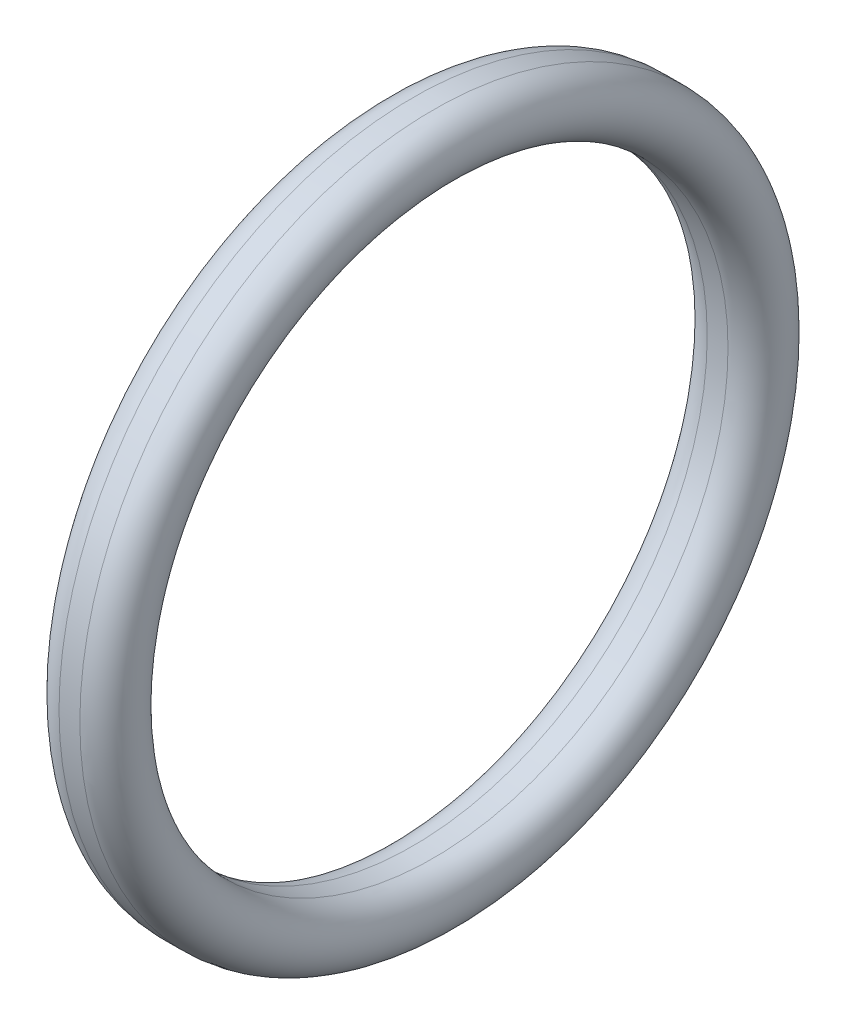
ISO-10303-21;
HEADER;
FILE_DESCRIPTION(('STEP AP214'),'2;1');
FILE_NAME('part.step','',(''),(''),'','','');
FILE_SCHEMA(('AUTOMOTIVE_DESIGN { 1 0 10303 214 1 1 1 1 }'));
ENDSEC;
DATA;
#1=APPLICATION_CONTEXT('core data for automotive mechanical design processes');
#2=APPLICATION_PROTOCOL_DEFINITION('international standard','automotive_design',2000,#1);
#3=PRODUCT_CONTEXT('',#1,'mechanical');
#4=PRODUCT('Part','Part','',(#3));
#5=PRODUCT_RELATED_PRODUCT_CATEGORY('part','',(#4));
#6=PRODUCT_DEFINITION_FORMATION('','',#4);
#7=PRODUCT_DEFINITION_CONTEXT('part definition',#1,'design');
#8=PRODUCT_DEFINITION('design','',#6,#7);
#9=PRODUCT_DEFINITION_SHAPE('','',#8);
#10=(LENGTH_UNIT() NAMED_UNIT(*) SI_UNIT(.MILLI.,.METRE.));
#11=(NAMED_UNIT(*) PLANE_ANGLE_UNIT() SI_UNIT($,.RADIAN.));
#12=(NAMED_UNIT(*) SI_UNIT($,.STERADIAN.) SOLID_ANGLE_UNIT());
#13=UNCERTAINTY_MEASURE_WITH_UNIT(LENGTH_MEASURE(1.E-05),#10,'distance_accuracy_value','');
#14=(GEOMETRIC_REPRESENTATION_CONTEXT(3) GLOBAL_UNCERTAINTY_ASSIGNED_CONTEXT((#13)) GLOBAL_UNIT_ASSIGNED_CONTEXT((#10,
#11,#12)) REPRESENTATION_CONTEXT('',''));
#15=CARTESIAN_POINT('',(0.,0.,0.));
#16=DIRECTION('',(0.,0.,1.));
#17=DIRECTION('',(1.,0.,0.));
#18=AXIS2_PLACEMENT_3D('',#15,#16,#17);
#19=CARTESIAN_POINT('',(-0.529499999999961,0.,0.));
#20=DIRECTION('',(-1.,0.,0.));
#21=DIRECTION('',(0.,0.,1.00000000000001));
#22=AXIS2_PLACEMENT_3D('',#19,#20,#21);
#23=TOROIDAL_SURFACE('',#22,16.50025,1.50025);
#24=CARTESIAN_POINT('',(-0.529499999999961,0.,0.));
#25=DIRECTION('',(-1.,0.,0.));
#26=DIRECTION('',(0.,0.,1.00000000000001));
#27=AXIS2_PLACEMENT_3D('',#24,#25,#26);
#28=CIRCLE('',#27,18.0005);
#29=CARTESIAN_POINT('',(-0.529499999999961,0.,18.0005000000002));
#30=VERTEX_POINT('',#29);
#31=EDGE_CURVE('E10',#30,#30,#28,.T.);
#32=ORIENTED_EDGE('',*,*,#31,.T.);
#33=EDGE_LOOP('',(#32));
#34=FACE_BOUND('',#33,.T.);
#35=CARTESIAN_POINT('',(-0.529499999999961,0.,0.));
#36=DIRECTION('',(-1.,0.,0.));
#37=DIRECTION('',(0.,0.,1.00000000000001));
#38=AXIS2_PLACEMENT_3D('',#35,#36,#37);
#39=CIRCLE('',#38,15.);
#40=CARTESIAN_POINT('',(-0.529499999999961,0.,15.0000000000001));
#41=VERTEX_POINT('',#40);
#42=EDGE_CURVE('E38',#41,#41,#39,.T.);
#43=ORIENTED_EDGE('',*,*,#42,.F.);
#44=EDGE_LOOP('',(#43));
#45=FACE_BOUND('',#44,.T.);
#46=ADVANCED_FACE('F14',(#34,#45),#23,.T.);
#47=CARTESIAN_POINT('',(0.,0.,0.));
#48=DIRECTION('',(-1.,0.,0.));
#49=DIRECTION('',(0.,0.,1.00000000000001));
#50=AXIS2_PLACEMENT_3D('',#47,#48,#49);
#51=CYLINDRICAL_SURFACE('',#50,18.0005);
#52=CARTESIAN_POINT('',(0.529499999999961,0.,0.));
#53=DIRECTION('',(-1.,0.,0.));
#54=DIRECTION('',(0.,0.,1.00000000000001));
#55=AXIS2_PLACEMENT_3D('',#52,#53,#54);
#56=CIRCLE('',#55,18.0005);
#57=CARTESIAN_POINT('',(0.529499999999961,0.,18.0005000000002));
#58=VERTEX_POINT('',#57);
#59=EDGE_CURVE('E21',#58,#58,#56,.T.);
#60=ORIENTED_EDGE('',*,*,#59,.T.);
#61=EDGE_LOOP('',(#60));
#62=FACE_BOUND('',#61,.T.);
#63=ORIENTED_EDGE('',*,*,#31,.F.);
#64=EDGE_LOOP('',(#63));
#65=FACE_BOUND('',#64,.T.);
#66=ADVANCED_FACE('F49',(#62,#65),#51,.T.);
#67=CARTESIAN_POINT('',(0.529499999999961,0.,0.));
#68=DIRECTION('',(-1.,0.,0.));
#69=DIRECTION('',(0.,0.,1.00000000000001));
#70=AXIS2_PLACEMENT_3D('',#67,#68,#69);
#71=TOROIDAL_SURFACE('',#70,16.50025,1.50025);
#72=CARTESIAN_POINT('',(0.529499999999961,0.,0.));
#73=DIRECTION('',(-1.,0.,0.));
#74=DIRECTION('',(0.,0.,1.00000000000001));
#75=AXIS2_PLACEMENT_3D('',#72,#73,#74);
#76=CIRCLE('',#75,15.);
#77=CARTESIAN_POINT('',(0.529499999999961,0.,15.0000000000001));
#78=VERTEX_POINT('',#77);
#79=EDGE_CURVE('E30',#78,#78,#76,.T.);
#80=ORIENTED_EDGE('',*,*,#79,.T.);
#81=EDGE_LOOP('',(#80));
#82=FACE_BOUND('',#81,.T.);
#83=ORIENTED_EDGE('',*,*,#59,.F.);
#84=EDGE_LOOP('',(#83));
#85=FACE_BOUND('',#84,.T.);
#86=ADVANCED_FACE('F53',(#82,#85),#71,.T.);
#87=CARTESIAN_POINT('',(0.,0.,0.));
#88=DIRECTION('',(-1.,0.,0.));
#89=DIRECTION('',(0.,0.,1.00000000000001));
#90=AXIS2_PLACEMENT_3D('',#87,#88,#89);
#91=CYLINDRICAL_SURFACE('',#90,15.);
#92=ORIENTED_EDGE('',*,*,#42,.T.);
#93=EDGE_LOOP('',(#92));
#94=FACE_BOUND('',#93,.T.);
#95=ORIENTED_EDGE('',*,*,#79,.F.);
#96=EDGE_LOOP('',(#95));
#97=FACE_BOUND('',#96,.T.);
#98=ADVANCED_FACE('F45',(#94,#97),#91,.F.);
#99=CLOSED_SHELL('',(#46,#66,#86,#98));
#100=MANIFOLD_SOLID_BREP('B1',#99);
#101=ADVANCED_BREP_SHAPE_REPRESENTATION('',(#18,#100),#14);
#102=SHAPE_DEFINITION_REPRESENTATION(#9,#101);
ENDSEC;
END-ISO-10303-21;
